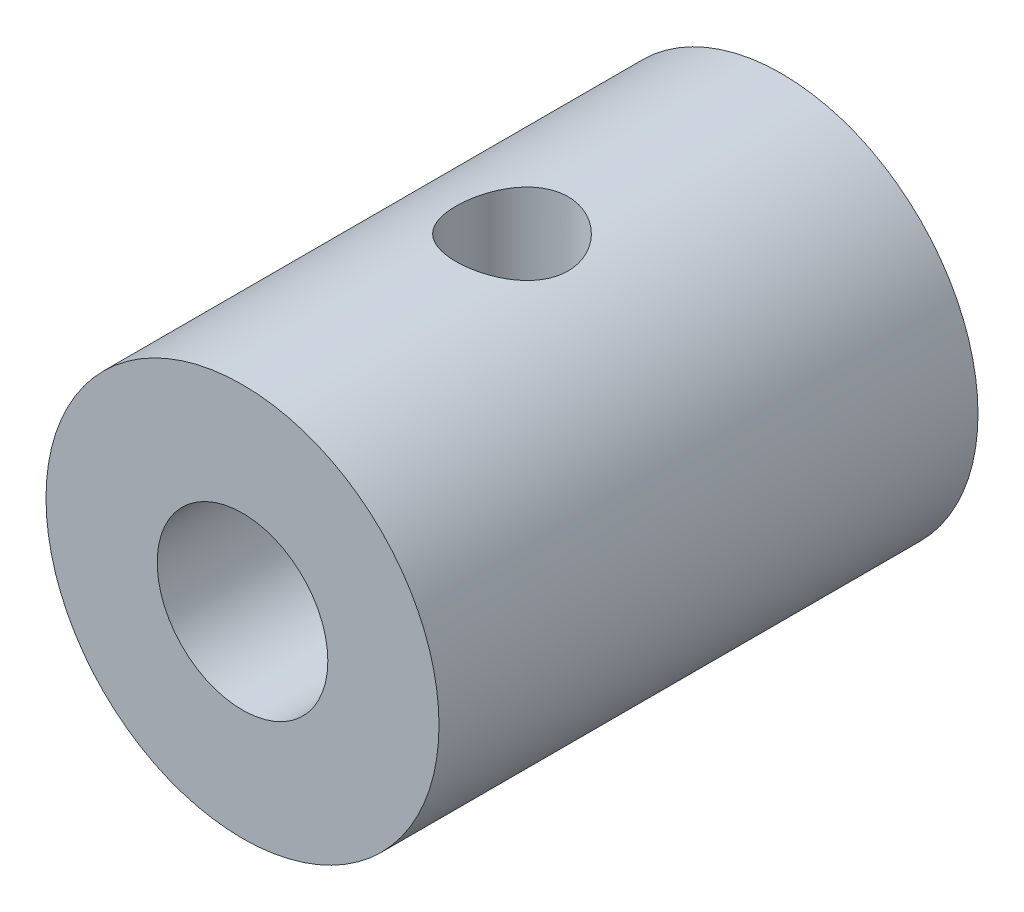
ISO-10303-21;
HEADER;
FILE_DESCRIPTION(('STEP AP214'),'2;1');
FILE_NAME('part.step','',(''),(''),'','','');
FILE_SCHEMA(('AUTOMOTIVE_DESIGN { 1 0 10303 214 1 1 1 1 }'));
ENDSEC;
DATA;
#1=APPLICATION_CONTEXT('core data for automotive mechanical design processes');
#2=APPLICATION_PROTOCOL_DEFINITION('international standard','automotive_design',2000,#1);
#3=PRODUCT_CONTEXT('',#1,'mechanical');
#4=PRODUCT('Part','Part','',(#3));
#5=PRODUCT_RELATED_PRODUCT_CATEGORY('part','',(#4));
#6=PRODUCT_DEFINITION_FORMATION('','',#4);
#7=PRODUCT_DEFINITION_CONTEXT('part definition',#1,'design');
#8=PRODUCT_DEFINITION('design','',#6,#7);
#9=PRODUCT_DEFINITION_SHAPE('','',#8);
#10=(LENGTH_UNIT() NAMED_UNIT(*) SI_UNIT(.MILLI.,.METRE.));
#11=(NAMED_UNIT(*) PLANE_ANGLE_UNIT() SI_UNIT($,.RADIAN.));
#12=(NAMED_UNIT(*) SI_UNIT($,.STERADIAN.) SOLID_ANGLE_UNIT());
#13=UNCERTAINTY_MEASURE_WITH_UNIT(LENGTH_MEASURE(1.E-05),#10,'distance_accuracy_value','');
#14=(GEOMETRIC_REPRESENTATION_CONTEXT(3) GLOBAL_UNCERTAINTY_ASSIGNED_CONTEXT((#13)) GLOBAL_UNIT_ASSIGNED_CONTEXT((#10,
#11,#12)) REPRESENTATION_CONTEXT('',''));
#15=CARTESIAN_POINT('',(0.,0.,0.));
#16=DIRECTION('',(0.,0.,1.));
#17=DIRECTION('',(1.,0.,0.));
#18=AXIS2_PLACEMENT_3D('',#15,#16,#17);
#19=CARTESIAN_POINT('',(0.,0.,-15.24));
#20=DIRECTION('',(0.,0.,1.));
#21=DIRECTION('',(1.,0.,0.));
#22=AXIS2_PLACEMENT_3D('',#19,#20,#21);
#23=CYLINDRICAL_SURFACE('',#22,5.55625);
#24=CARTESIAN_POINT('',(0.,-5.55625,-6.0325));
#25=CARTESIAN_POINT('',(-0.0872767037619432,-5.55624896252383,-6.0325015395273));
#26=CARTESIAN_POINT('',(-0.174569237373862,-5.55417368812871,-6.03972136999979));
#27=CARTESIAN_POINT('',(-0.34662426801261,-5.54609719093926,-6.06834913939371));
#28=CARTESIAN_POINT('',(-0.431385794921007,-5.54009448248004,-6.08976244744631));
#29=CARTESIAN_POINT('',(-0.595871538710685,-5.52482298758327,-6.1460126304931));
#30=CARTESIAN_POINT('',(-0.675602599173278,-5.51555875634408,-6.18083078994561));
#31=CARTESIAN_POINT('',(-0.828094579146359,-5.49473420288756,-6.26282878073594));
#32=CARTESIAN_POINT('',(-0.900854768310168,-5.48317364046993,-6.31000990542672));
#33=CARTESIAN_POINT('',(-1.03925246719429,-5.45865633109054,-6.41670278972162));
#34=CARTESIAN_POINT('',(-1.10468070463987,-5.44567302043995,-6.47647989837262));
#35=CARTESIAN_POINT('',(-1.22473351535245,-5.4199372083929,-6.60610164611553));
#36=CARTESIAN_POINT('',(-1.27935646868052,-5.40718474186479,-6.67594779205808));
#37=CARTESIAN_POINT('',(-1.37731333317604,-5.38307768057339,-6.82545115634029));
#38=CARTESIAN_POINT('',(-1.42039833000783,-5.37175632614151,-6.90527732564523));
#39=CARTESIAN_POINT('',(-1.49244979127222,-5.35218754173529,-7.07141715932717));
#40=CARTESIAN_POINT('',(-1.52141929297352,-5.34393945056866,-7.15772942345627));
#41=CARTESIAN_POINT('',(-1.56367506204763,-5.33172676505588,-7.33205509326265));
#42=CARTESIAN_POINT('',(-1.57734439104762,-5.32765776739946,-7.41996814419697));
#43=CARTESIAN_POINT('',(-1.58980717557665,-5.32395277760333,-7.59692659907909));
#44=CARTESIAN_POINT('',(-1.58860386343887,-5.32431582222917,-7.68597175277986));
#45=CARTESIAN_POINT('',(-1.57165781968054,-5.32934096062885,-7.85960821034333));
#46=CARTESIAN_POINT('',(-1.5563875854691,-5.33386333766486,-7.94425032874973));
#47=CARTESIAN_POINT('',(-1.51250162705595,-5.34647257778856,-8.1097177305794));
#48=CARTESIAN_POINT('',(-1.48388469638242,-5.3545597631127,-8.1905426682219));
#49=CARTESIAN_POINT('',(-1.41375353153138,-5.37350385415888,-8.34727045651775));
#50=CARTESIAN_POINT('',(-1.37208062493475,-5.38439452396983,-8.42309805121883));
#51=CARTESIAN_POINT('',(-1.27713088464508,-5.40770140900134,-8.56684577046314));
#52=CARTESIAN_POINT('',(-1.22385146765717,-5.42011796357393,-8.63476412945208));
#53=CARTESIAN_POINT('',(-1.1048237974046,-5.44565086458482,-8.76345432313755));
#54=CARTESIAN_POINT('',(-1.03868130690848,-5.45877594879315,-8.82386036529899));
#55=CARTESIAN_POINT('',(-0.897042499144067,-5.48383021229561,-8.93280376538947));
#56=CARTESIAN_POINT('',(-0.821545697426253,-5.49575932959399,-8.98134050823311));
#57=CARTESIAN_POINT('',(-0.662720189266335,-5.51716994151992,-9.06536218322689));
#58=CARTESIAN_POINT('',(-0.579350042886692,-5.52663737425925,-9.10077260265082));
#59=CARTESIAN_POINT('',(-0.407505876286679,-5.5419565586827,-9.1569650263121));
#60=CARTESIAN_POINT('',(-0.319033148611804,-5.54780922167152,-9.17775071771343));
#61=CARTESIAN_POINT('',(-0.142610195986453,-5.55509806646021,-9.20351004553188));
#62=CARTESIAN_POINT('',(-0.0547380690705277,-5.55667285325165,-9.20898010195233));
#63=CARTESIAN_POINT('',(0.120671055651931,-5.55563154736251,-9.20533523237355));
#64=CARTESIAN_POINT('',(0.208208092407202,-5.55301595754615,-9.19622205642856));
#65=CARTESIAN_POINT('',(0.378633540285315,-5.54397804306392,-9.16407358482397));
#66=CARTESIAN_POINT('',(0.461580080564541,-5.53763349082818,-9.14132253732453));
#67=CARTESIAN_POINT('',(0.622465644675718,-5.52186474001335,-9.08288085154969));
#68=CARTESIAN_POINT('',(0.700404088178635,-5.51244018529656,-9.04718871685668));
#69=CARTESIAN_POINT('',(0.850933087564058,-5.49124156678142,-8.96300647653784));
#70=CARTESIAN_POINT('',(0.923371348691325,-5.47942105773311,-8.91425604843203));
#71=CARTESIAN_POINT('',(1.05921058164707,-5.45479245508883,-8.80566207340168));
#72=CARTESIAN_POINT('',(1.12260949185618,-5.44198413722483,-8.7458160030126));
#73=CARTESIAN_POINT('',(1.24071572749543,-5.41630091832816,-8.61440258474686));
#74=CARTESIAN_POINT('',(1.29507093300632,-5.40343754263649,-8.54251587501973));
#75=CARTESIAN_POINT('',(1.39096378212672,-5.37955247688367,-8.39036407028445));
#76=CARTESIAN_POINT('',(1.43250187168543,-5.36853072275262,-8.31009926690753));
#77=CARTESIAN_POINT('',(1.50127854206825,-5.34970554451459,-8.14380260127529));
#78=CARTESIAN_POINT('',(1.52859290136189,-5.34188511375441,-8.05780411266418));
#79=CARTESIAN_POINT('',(1.56828688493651,-5.33036825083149,-7.88216773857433));
#80=CARTESIAN_POINT('',(1.58067103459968,-5.32667056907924,-7.79253096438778));
#81=CARTESIAN_POINT('',(1.58986556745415,-5.32393289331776,-7.61579627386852));
#82=CARTESIAN_POINT('',(1.58724621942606,-5.32472233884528,-7.52873025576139));
#83=CARTESIAN_POINT('',(1.56785239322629,-5.33046461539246,-7.35633630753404));
#84=CARTESIAN_POINT('',(1.55107838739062,-5.335417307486,-7.27100831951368));
#85=CARTESIAN_POINT('',(1.50420362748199,-5.34881913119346,-7.10534966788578));
#86=CARTESIAN_POINT('',(1.47424054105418,-5.35723208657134,-7.02497691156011));
#87=CARTESIAN_POINT('',(1.4019446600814,-5.37660296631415,-6.87033587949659));
#88=CARTESIAN_POINT('',(1.35960967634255,-5.38756134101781,-6.79606868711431));
#89=CARTESIAN_POINT('',(1.26211446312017,-5.41124512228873,-6.65306682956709));
#90=CARTESIAN_POINT('',(1.20657324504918,-5.42401730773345,-6.58459964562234));
#91=CARTESIAN_POINT('',(1.08494499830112,-5.44964814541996,-6.45777228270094));
#92=CARTESIAN_POINT('',(1.0188553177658,-5.46250681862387,-6.3994146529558));
#93=CARTESIAN_POINT('',(0.875962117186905,-5.48725692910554,-6.29297923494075));
#94=CARTESIAN_POINT('',(0.798927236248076,-5.49911508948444,-6.24520357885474));
#95=CARTESIAN_POINT('',(0.637580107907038,-5.52014545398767,-6.16335303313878));
#96=CARTESIAN_POINT('',(0.553271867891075,-5.52931912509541,-6.12927065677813));
#97=CARTESIAN_POINT('',(0.391252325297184,-5.54297329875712,-6.07945225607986));
#98=CARTESIAN_POINT('',(0.31413688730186,-5.54791311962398,-6.06188975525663));
#99=CARTESIAN_POINT('',(0.158018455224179,-5.55455172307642,-6.03841370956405));
#100=CARTESIAN_POINT('',(0.0790157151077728,-5.55625093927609,-6.03249860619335));
#101=CARTESIAN_POINT('',(0.,-5.55625,-6.0325));
#102=B_SPLINE_CURVE_WITH_KNOTS('',3,(#24,#25,#26,#27,#28,#29,#30,#31,#32,#33,#34,#35,#36,#37,
#38,#39,#40,#41,#42,#43,#44,#45,#46,#47,#48,#49,#50,#51,#52,#53,#54,#55,#56,#57,#58,#59,#60,#61,
#62,#63,#64,#65,#66,#67,#68,#69,#70,#71,#72,#73,#74,#75,#76,#77,#78,#79,#80,#81,#82,#83,#84,#85,
#86,#87,#88,#89,#90,#91,#92,#93,#94,#95,#96,#97,#98,#99,#100,#101),.UNSPECIFIED.,.T.,.F.,(4,2,2,
2,2,2,2,2,2,2,2,2,2,2,2,2,2,2,2,2,2,2,2,2,2,2,2,2,2,2,2,2,2,2,2,2,2,2,4),(0.,0.261540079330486,
0.523179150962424,0.784454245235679,1.04575668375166,1.31324200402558,1.5807673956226,
1.8536687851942,2.12651142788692,2.39235860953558,2.65814801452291,2.91532298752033,
3.17252121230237,3.43297512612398,3.69348706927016,3.96381684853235,4.23416063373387,
4.50601636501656,4.77780353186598,5.04067332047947,5.30351156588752,5.56105330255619,
5.81862482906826,6.08177223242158,6.34497955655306,6.6167960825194,6.88860315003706,
7.15894692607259,7.42920873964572,7.68926803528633,7.94931865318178,8.20671695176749,
8.46416082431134,8.73019952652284,8.99630521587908,9.26923770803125,9.54202077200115,
9.77883702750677,10.0156215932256),.UNSPECIFIED.);
#103=CARTESIAN_POINT('',(0.,-5.55625,-6.0325));
#104=VERTEX_POINT('',#103);
#105=EDGE_CURVE('E79',#104,#104,#102,.T.);
#106=ORIENTED_EDGE('',*,*,#105,.F.);
#107=EDGE_LOOP('',(#106));
#108=FACE_BOUND('',#107,.T.);
#109=CARTESIAN_POINT('',(0.,5.55625,-6.0325));
#110=CARTESIAN_POINT('',(0.0872767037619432,5.55624896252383,-6.0325015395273));
#111=CARTESIAN_POINT('',(0.174569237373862,5.55417368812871,-6.03972136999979));
#112=CARTESIAN_POINT('',(0.34662426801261,5.54609719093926,-6.06834913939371));
#113=CARTESIAN_POINT('',(0.431385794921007,5.54009448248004,-6.08976244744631));
#114=CARTESIAN_POINT('',(0.595871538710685,5.52482298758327,-6.1460126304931));
#115=CARTESIAN_POINT('',(0.675602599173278,5.51555875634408,-6.18083078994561));
#116=CARTESIAN_POINT('',(0.828094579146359,5.49473420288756,-6.26282878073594));
#117=CARTESIAN_POINT('',(0.900854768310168,5.48317364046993,-6.31000990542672));
#118=CARTESIAN_POINT('',(1.03925246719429,5.45865633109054,-6.41670278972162));
#119=CARTESIAN_POINT('',(1.10468070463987,5.44567302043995,-6.47647989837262));
#120=CARTESIAN_POINT('',(1.22473351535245,5.4199372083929,-6.60610164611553));
#121=CARTESIAN_POINT('',(1.27935646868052,5.40718474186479,-6.67594779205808));
#122=CARTESIAN_POINT('',(1.37731333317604,5.38307768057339,-6.82545115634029));
#123=CARTESIAN_POINT('',(1.42039833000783,5.37175632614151,-6.90527732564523));
#124=CARTESIAN_POINT('',(1.49244979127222,5.35218754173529,-7.07141715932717));
#125=CARTESIAN_POINT('',(1.52141929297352,5.34393945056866,-7.15772942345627));
#126=CARTESIAN_POINT('',(1.56367506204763,5.33172676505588,-7.33205509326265));
#127=CARTESIAN_POINT('',(1.57734439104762,5.32765776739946,-7.41996814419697));
#128=CARTESIAN_POINT('',(1.58980717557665,5.32395277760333,-7.59692659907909));
#129=CARTESIAN_POINT('',(1.58860386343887,5.32431582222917,-7.68597175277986));
#130=CARTESIAN_POINT('',(1.57165781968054,5.32934096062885,-7.85960821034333));
#131=CARTESIAN_POINT('',(1.5563875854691,5.33386333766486,-7.94425032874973));
#132=CARTESIAN_POINT('',(1.51250162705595,5.34647257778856,-8.1097177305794));
#133=CARTESIAN_POINT('',(1.48388469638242,5.3545597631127,-8.1905426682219));
#134=CARTESIAN_POINT('',(1.41375353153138,5.37350385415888,-8.34727045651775));
#135=CARTESIAN_POINT('',(1.37208062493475,5.38439452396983,-8.42309805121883));
#136=CARTESIAN_POINT('',(1.27713088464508,5.40770140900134,-8.56684577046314));
#137=CARTESIAN_POINT('',(1.22385146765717,5.42011796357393,-8.63476412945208));
#138=CARTESIAN_POINT('',(1.1048237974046,5.44565086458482,-8.76345432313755));
#139=CARTESIAN_POINT('',(1.03868130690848,5.45877594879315,-8.82386036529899));
#140=CARTESIAN_POINT('',(0.897042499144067,5.48383021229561,-8.93280376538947));
#141=CARTESIAN_POINT('',(0.821545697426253,5.49575932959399,-8.98134050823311));
#142=CARTESIAN_POINT('',(0.662720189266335,5.51716994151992,-9.06536218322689));
#143=CARTESIAN_POINT('',(0.579350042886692,5.52663737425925,-9.10077260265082));
#144=CARTESIAN_POINT('',(0.407505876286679,5.5419565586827,-9.1569650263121));
#145=CARTESIAN_POINT('',(0.319033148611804,5.54780922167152,-9.17775071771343));
#146=CARTESIAN_POINT('',(0.142610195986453,5.55509806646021,-9.20351004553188));
#147=CARTESIAN_POINT('',(0.0547380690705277,5.55667285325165,-9.20898010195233));
#148=CARTESIAN_POINT('',(-0.120671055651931,5.55563154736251,-9.20533523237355));
#149=CARTESIAN_POINT('',(-0.208208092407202,5.55301595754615,-9.19622205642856));
#150=CARTESIAN_POINT('',(-0.378633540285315,5.54397804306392,-9.16407358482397));
#151=CARTESIAN_POINT('',(-0.461580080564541,5.53763349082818,-9.14132253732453));
#152=CARTESIAN_POINT('',(-0.622465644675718,5.52186474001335,-9.08288085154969));
#153=CARTESIAN_POINT('',(-0.700404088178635,5.51244018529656,-9.04718871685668));
#154=CARTESIAN_POINT('',(-0.850933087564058,5.49124156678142,-8.96300647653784));
#155=CARTESIAN_POINT('',(-0.923371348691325,5.47942105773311,-8.91425604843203));
#156=CARTESIAN_POINT('',(-1.05921058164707,5.45479245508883,-8.80566207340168));
#157=CARTESIAN_POINT('',(-1.12260949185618,5.44198413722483,-8.7458160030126));
#158=CARTESIAN_POINT('',(-1.24071572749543,5.41630091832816,-8.61440258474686));
#159=CARTESIAN_POINT('',(-1.29507093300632,5.40343754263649,-8.54251587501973));
#160=CARTESIAN_POINT('',(-1.39096378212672,5.37955247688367,-8.39036407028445));
#161=CARTESIAN_POINT('',(-1.43250187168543,5.36853072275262,-8.31009926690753));
#162=CARTESIAN_POINT('',(-1.50127854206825,5.34970554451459,-8.14380260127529));
#163=CARTESIAN_POINT('',(-1.52859290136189,5.34188511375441,-8.05780411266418));
#164=CARTESIAN_POINT('',(-1.56828688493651,5.33036825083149,-7.88216773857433));
#165=CARTESIAN_POINT('',(-1.58067103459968,5.32667056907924,-7.79253096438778));
#166=CARTESIAN_POINT('',(-1.58986556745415,5.32393289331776,-7.61579627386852));
#167=CARTESIAN_POINT('',(-1.58724621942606,5.32472233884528,-7.52873025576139));
#168=CARTESIAN_POINT('',(-1.56785239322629,5.33046461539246,-7.35633630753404));
#169=CARTESIAN_POINT('',(-1.55107838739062,5.335417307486,-7.27100831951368));
#170=CARTESIAN_POINT('',(-1.50420362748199,5.34881913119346,-7.10534966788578));
#171=CARTESIAN_POINT('',(-1.47424054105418,5.35723208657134,-7.02497691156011));
#172=CARTESIAN_POINT('',(-1.4019446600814,5.37660296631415,-6.87033587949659));
#173=CARTESIAN_POINT('',(-1.35960967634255,5.38756134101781,-6.79606868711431));
#174=CARTESIAN_POINT('',(-1.26211446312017,5.41124512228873,-6.65306682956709));
#175=CARTESIAN_POINT('',(-1.20657324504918,5.42401730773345,-6.58459964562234));
#176=CARTESIAN_POINT('',(-1.08494499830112,5.44964814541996,-6.45777228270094));
#177=CARTESIAN_POINT('',(-1.0188553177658,5.46250681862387,-6.3994146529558));
#178=CARTESIAN_POINT('',(-0.875962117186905,5.48725692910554,-6.29297923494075));
#179=CARTESIAN_POINT('',(-0.798927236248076,5.49911508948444,-6.24520357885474));
#180=CARTESIAN_POINT('',(-0.637580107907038,5.52014545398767,-6.16335303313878));
#181=CARTESIAN_POINT('',(-0.553271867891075,5.52931912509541,-6.12927065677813));
#182=CARTESIAN_POINT('',(-0.391252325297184,5.54297329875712,-6.07945225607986));
#183=CARTESIAN_POINT('',(-0.31413688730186,5.54791311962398,-6.06188975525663));
#184=CARTESIAN_POINT('',(-0.158018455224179,5.55455172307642,-6.03841370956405));
#185=CARTESIAN_POINT('',(-0.0790157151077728,5.55625093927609,-6.03249860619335));
#186=CARTESIAN_POINT('',(0.,5.55625,-6.0325));
#187=B_SPLINE_CURVE_WITH_KNOTS('',3,(#109,#110,#111,#112,#113,#114,#115,#116,#117,#118,#119,
#120,#121,#122,#123,#124,#125,#126,#127,#128,#129,#130,#131,#132,#133,#134,#135,#136,#137,#138,
#139,#140,#141,#142,#143,#144,#145,#146,#147,#148,#149,#150,#151,#152,#153,#154,#155,#156,#157,
#158,#159,#160,#161,#162,#163,#164,#165,#166,#167,#168,#169,#170,#171,#172,#173,#174,#175,#176,
#177,#178,#179,#180,#181,#182,#183,#184,#185,#186),.UNSPECIFIED.,.T.,.F.,(4,2,2,2,2,2,2,2,2,2,2,
2,2,2,2,2,2,2,2,2,2,2,2,2,2,2,2,2,2,2,2,2,2,2,2,2,2,2,4),(0.,0.261540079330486,
0.523179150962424,0.784454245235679,1.04575668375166,1.31324200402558,1.5807673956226,
1.8536687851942,2.12651142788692,2.39235860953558,2.65814801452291,2.91532298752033,
3.17252121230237,3.43297512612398,3.69348706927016,3.96381684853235,4.23416063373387,
4.50601636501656,4.77780353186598,5.04067332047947,5.30351156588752,5.56105330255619,
5.81862482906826,6.08177223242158,6.34497955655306,6.6167960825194,6.88860315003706,
7.15894692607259,7.42920873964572,7.68926803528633,7.94931865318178,8.20671695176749,
8.46416082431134,8.73019952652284,8.99630521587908,9.26923770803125,9.54202077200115,
9.77883702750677,10.0156215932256),.UNSPECIFIED.);
#188=CARTESIAN_POINT('',(0.,5.55625,-6.0325));
#189=VERTEX_POINT('',#188);
#190=EDGE_CURVE('E74',#189,#189,#187,.T.);
#191=ORIENTED_EDGE('',*,*,#190,.F.);
#192=EDGE_LOOP('',(#191));
#193=FACE_BOUND('',#192,.T.);
#194=CARTESIAN_POINT('',(0.,0.,-15.24));
#195=DIRECTION('',(0.,0.,1.));
#196=DIRECTION('',(1.,0.,0.));
#197=AXIS2_PLACEMENT_3D('',#194,#195,#196);
#198=CIRCLE('',#197,5.55625);
#199=CARTESIAN_POINT('',(5.55625,0.,-15.24));
#200=VERTEX_POINT('',#199);
#201=EDGE_CURVE('E10',#200,#200,#198,.T.);
#202=ORIENTED_EDGE('',*,*,#201,.T.);
#203=EDGE_LOOP('',(#202));
#204=FACE_BOUND('',#203,.T.);
#205=CARTESIAN_POINT('',(0.,0.,0.));
#206=DIRECTION('',(0.,0.,1.));
#207=DIRECTION('',(1.,0.,0.));
#208=AXIS2_PLACEMENT_3D('',#205,#206,#207);
#209=CIRCLE('',#208,5.55625);
#210=CARTESIAN_POINT('',(5.55625,0.,0.));
#211=VERTEX_POINT('',#210);
#212=EDGE_CURVE('E46',#211,#211,#209,.T.);
#213=ORIENTED_EDGE('',*,*,#212,.F.);
#214=EDGE_LOOP('',(#213));
#215=FACE_BOUND('',#214,.T.);
#216=ADVANCED_FACE('F33',(#108,#193,#204,#215),#23,.T.);
#217=CARTESIAN_POINT('',(0.,0.,-15.24));
#218=DIRECTION('',(0.,0.,1.));
#219=DIRECTION('',(1.,0.,0.));
#220=AXIS2_PLACEMENT_3D('',#217,#218,#219);
#221=PLANE('',#220);
#222=CARTESIAN_POINT('',(0.,0.,-15.24));
#223=DIRECTION('',(0.,0.,1.));
#224=DIRECTION('',(1.,0.,0.));
#225=AXIS2_PLACEMENT_3D('',#222,#223,#224);
#226=CIRCLE('',#225,2.413);
#227=CARTESIAN_POINT('',(2.413,0.,-15.24));
#228=VERTEX_POINT('',#227);
#229=EDGE_CURVE('E51',#228,#228,#226,.T.);
#230=ORIENTED_EDGE('',*,*,#229,.T.);
#231=EDGE_LOOP('',(#230));
#232=FACE_BOUND('',#231,.T.);
#233=ORIENTED_EDGE('',*,*,#201,.F.);
#234=EDGE_LOOP('',(#233));
#235=FACE_BOUND('',#234,.T.);
#236=ADVANCED_FACE('F94',(#232,#235),#221,.F.);
#237=CARTESIAN_POINT('',(0.,0.,0.));
#238=DIRECTION('',(0.,0.,1.));
#239=DIRECTION('',(1.,0.,0.));
#240=AXIS2_PLACEMENT_3D('',#237,#238,#239);
#241=PLANE('',#240);
#242=CARTESIAN_POINT('',(0.,0.,0.));
#243=DIRECTION('',(0.,0.,1.));
#244=DIRECTION('',(1.,0.,0.));
#245=AXIS2_PLACEMENT_3D('',#242,#243,#244);
#246=CIRCLE('',#245,2.413);
#247=CARTESIAN_POINT('',(2.413,0.,0.));
#248=VERTEX_POINT('',#247);
#249=EDGE_CURVE('E54',#248,#248,#246,.T.);
#250=ORIENTED_EDGE('',*,*,#249,.F.);
#251=EDGE_LOOP('',(#250));
#252=FACE_BOUND('',#251,.T.);
#253=ORIENTED_EDGE('',*,*,#212,.T.);
#254=EDGE_LOOP('',(#253));
#255=FACE_BOUND('',#254,.T.);
#256=ADVANCED_FACE('F91',(#252,#255),#241,.T.);
#257=CARTESIAN_POINT('',(0.,0.,-15.24));
#258=DIRECTION('',(0.,0.,1.));
#259=DIRECTION('',(1.,0.,0.));
#260=AXIS2_PLACEMENT_3D('',#257,#258,#259);
#261=CYLINDRICAL_SURFACE('',#260,2.413);
#262=CARTESIAN_POINT('',(0.,-2.413,-6.0325));
#263=CARTESIAN_POINT('',(-0.0799588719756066,-2.41299835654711,-6.03250167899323));
#264=CARTESIAN_POINT('',(-0.159933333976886,-2.40898996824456,-6.0385753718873));
#265=CARTESIAN_POINT('',(-0.31734518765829,-2.39335125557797,-6.06250280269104));
#266=CARTESIAN_POINT('',(-0.39478086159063,-2.38171587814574,-6.08036435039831));
#267=CARTESIAN_POINT('',(-0.544600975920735,-2.35197589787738,-6.12678437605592));
#268=CARTESIAN_POINT('',(-0.617007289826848,-2.33390171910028,-6.15529257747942));
#269=CARTESIAN_POINT('',(-0.755727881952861,-2.29274654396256,-6.2218027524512));
#270=CARTESIAN_POINT('',(-0.822041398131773,-2.26966492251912,-6.25980591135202));
#271=CARTESIAN_POINT('',(-0.952971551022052,-2.21805576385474,-6.34770575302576));
#272=CARTESIAN_POINT('',(-1.01697952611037,-2.18923385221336,-6.39833257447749));
#273=CARTESIAN_POINT('',(-1.13617571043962,-2.12981680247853,-6.50831199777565));
#274=CARTESIAN_POINT('',(-1.19135125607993,-2.09921920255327,-6.56767689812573));
#275=CARTESIAN_POINT('',(-1.29994052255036,-2.03403850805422,-6.70401260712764));
#276=CARTESIAN_POINT('',(-1.35179336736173,-1.99956180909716,-6.78228745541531));
#277=CARTESIAN_POINT('',(-1.44152434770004,-1.93587363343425,-6.94840765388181));
#278=CARTESIAN_POINT('',(-1.479426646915,-1.90665309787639,-7.03623611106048));
#279=CARTESIAN_POINT('',(-1.53081720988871,-1.8654576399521,-7.19391086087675));
#280=CARTESIAN_POINT('',(-1.54817785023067,-1.85094275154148,-7.26182519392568));
#281=CARTESIAN_POINT('',(-1.57381605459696,-1.82919719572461,-7.40043861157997));
#282=CARTESIAN_POINT('',(-1.58210865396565,-1.82195447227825,-7.47113288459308));
#283=CARTESIAN_POINT('',(-1.58909442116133,-1.81586727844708,-7.6136379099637));
#284=CARTESIAN_POINT('',(-1.58775173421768,-1.81705417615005,-7.68545183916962));
#285=CARTESIAN_POINT('',(-1.57548041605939,-1.82770073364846,-7.82765505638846));
#286=CARTESIAN_POINT('',(-1.56454370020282,-1.83716737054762,-7.89804309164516));
#287=CARTESIAN_POINT('',(-1.53438969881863,-1.8624122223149,-8.03278512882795));
#288=CARTESIAN_POINT('',(-1.51551302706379,-1.87792908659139,-8.0972674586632));
#289=CARTESIAN_POINT('',(-1.47034216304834,-1.91350135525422,-8.22222028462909));
#290=CARTESIAN_POINT('',(-1.44404553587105,-1.93355824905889,-8.28268945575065));
#291=CARTESIAN_POINT('',(-1.37874791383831,-1.98079549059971,-8.41080095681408));
#292=CARTESIAN_POINT('',(-1.33825710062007,-2.00859791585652,-8.47745281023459));
#293=CARTESIAN_POINT('',(-1.24833470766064,-2.06568961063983,-8.60378803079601));
#294=CARTESIAN_POINT('',(-1.19889220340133,-2.09498066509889,-8.66346273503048));
#295=CARTESIAN_POINT('',(-1.08065804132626,-2.158733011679,-8.78663353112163));
#296=CARTESIAN_POINT('',(-1.00997691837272,-2.19302872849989,-8.84842174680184));
#297=CARTESIAN_POINT('',(-0.857461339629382,-2.25702187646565,-8.9593203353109));
#298=CARTESIAN_POINT('',(-0.775638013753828,-2.28672383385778,-9.00844321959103));
#299=CARTESIAN_POINT('',(-0.619595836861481,-2.33322350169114,-9.08362744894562));
#300=CARTESIAN_POINT('',(-0.547063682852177,-2.35141109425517,-9.11232689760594));
#301=CARTESIAN_POINT('',(-0.397349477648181,-2.3812794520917,-9.15896140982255));
#302=CARTESIAN_POINT('',(-0.320171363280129,-2.39296564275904,-9.17690544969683));
#303=CARTESIAN_POINT('',(-0.162905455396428,-2.40879578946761,-9.20112926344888));
#304=CARTESIAN_POINT('',(-0.0828073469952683,-2.41290968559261,-9.20736255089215));
#305=CARTESIAN_POINT('',(0.0774224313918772,-2.41308731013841,-9.20763288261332));
#306=CARTESIAN_POINT('',(0.15755410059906,-2.40915121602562,-9.20167019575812));
#307=CARTESIAN_POINT('',(0.310151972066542,-2.39413427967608,-9.1786962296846));
#308=CARTESIAN_POINT('',(0.382779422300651,-2.3835300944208,-9.16242153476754));
#309=CARTESIAN_POINT('',(0.524047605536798,-2.35650584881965,-9.120322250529));
#310=CARTESIAN_POINT('',(0.592687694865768,-2.34008485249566,-9.09449612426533));
#311=CARTESIAN_POINT('',(0.729044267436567,-2.30139348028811,-9.0323139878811));
#312=CARTESIAN_POINT('',(0.796405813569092,-2.27881043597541,-8.99537910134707));
#313=CARTESIAN_POINT('',(0.924235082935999,-2.23003319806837,-8.9129574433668));
#314=CARTESIAN_POINT('',(0.984698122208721,-2.20383657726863,-8.86746491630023));
#315=CARTESIAN_POINT('',(1.10702139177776,-2.14531062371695,-8.76114857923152));
#316=CARTESIAN_POINT('',(1.16761337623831,-2.11266384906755,-8.69903926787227));
#317=CARTESIAN_POINT('',(1.27804416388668,-2.04774901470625,-8.56565433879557));
#318=CARTESIAN_POINT('',(1.32787711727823,-2.01548116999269,-8.49437376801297));
#319=CARTESIAN_POINT('',(1.4112232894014,-1.95788457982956,-8.35125276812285));
#320=CARTESIAN_POINT('',(1.44589422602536,-1.93218319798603,-8.28024013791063));
#321=CARTESIAN_POINT('',(1.50469449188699,-1.8867567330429,-8.13221510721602));
#322=CARTESIAN_POINT('',(1.52884286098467,-1.86702087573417,-8.05521384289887));
#323=CARTESIAN_POINT('',(1.56231525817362,-1.83905936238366,-7.90973144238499));
#324=CARTESIAN_POINT('',(1.5734227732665,-1.82947554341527,-7.84192837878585));
#325=CARTESIAN_POINT('',(1.58672331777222,-1.81795542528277,-7.70483162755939));
#326=CARTESIAN_POINT('',(1.58892454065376,-1.81601209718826,-7.635539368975));
#327=CARTESIAN_POINT('',(1.58427385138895,-1.82006930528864,-7.49751688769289));
#328=CARTESIAN_POINT('',(1.57742315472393,-1.82606877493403,-7.42878659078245));
#329=CARTESIAN_POINT('',(1.55511847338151,-1.8450971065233,-7.29371173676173));
#330=CARTESIAN_POINT('',(1.53965318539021,-1.85813520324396,-7.22737043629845));
#331=CARTESIAN_POINT('',(1.49541513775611,-1.89402181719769,-7.08024277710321));
#332=CARTESIAN_POINT('',(1.46412276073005,-1.9185982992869,-7.00064253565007));
#333=CARTESIAN_POINT('',(1.39017287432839,-1.97283748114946,-6.84881027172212));
#334=CARTESIAN_POINT('',(1.34749962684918,-2.00250720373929,-6.77658864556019));
#335=CARTESIAN_POINT('',(1.25103580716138,-2.06417332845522,-6.63906478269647));
#336=CARTESIAN_POINT('',(1.19707006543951,-2.09620050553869,-6.57389960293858));
#337=CARTESIAN_POINT('',(1.07919367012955,-2.15925474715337,-6.45267580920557));
#338=CARTESIAN_POINT('',(1.01528024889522,-2.19028153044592,-6.39661973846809));
#339=CARTESIAN_POINT('',(0.869916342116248,-2.25228411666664,-6.28862709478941));
#340=CARTESIAN_POINT('',(0.787280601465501,-2.28280298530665,-6.23800151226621));
#341=CARTESIAN_POINT('',(0.612112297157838,-2.3358521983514,-6.15202924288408));
#342=CARTESIAN_POINT('',(0.519599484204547,-2.35839811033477,-6.11665275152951));
#343=CARTESIAN_POINT('',(0.355448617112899,-2.3876883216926,-6.0711797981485));
#344=CARTESIAN_POINT('',(0.285472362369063,-2.39711346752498,-6.05673690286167));
#345=CARTESIAN_POINT('',(0.143667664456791,-2.40976856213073,-6.03739853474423));
#346=CARTESIAN_POINT('',(0.0718401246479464,-2.41300147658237,-6.03249849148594));
#347=CARTESIAN_POINT('',(0.,-2.413,-6.0325));
#348=B_SPLINE_CURVE_WITH_KNOTS('',3,(#262,#263,#264,#265,#266,#267,#268,#269,#270,#271,#272,
#273,#274,#275,#276,#277,#278,#279,#280,#281,#282,#283,#284,#285,#286,#287,#288,#289,#290,#291,
#292,#293,#294,#295,#296,#297,#298,#299,#300,#301,#302,#303,#304,#305,#306,#307,#308,#309,#310,
#311,#312,#313,#314,#315,#316,#317,#318,#319,#320,#321,#322,#323,#324,#325,#326,#327,#328,#329,
#330,#331,#332,#333,#334,#335,#336,#337,#338,#339,#340,#341,#342,#343,#344,#345,#346,#347),
.UNSPECIFIED.,.T.,.F.,(4,2,2,2,2,2,2,2,2,2,2,2,2,2,2,2,2,2,2,2,2,2,2,2,2,2,2,2,2,2,2,2,2,2,2,2,
2,2,2,2,2,2,4),(0.,0.239585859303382,0.479330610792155,0.717957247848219,0.956613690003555,
1.21528407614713,1.47432207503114,1.77298889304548,2.07113592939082,2.28503135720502,
2.49857159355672,2.71290686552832,2.9274229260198,3.13354851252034,3.33974181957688,
3.58725053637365,3.83506337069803,4.13347849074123,4.43159768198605,4.67087501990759,
4.90995238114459,5.14997678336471,5.38999589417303,5.61455116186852,5.83914257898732,
6.07844377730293,6.31790650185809,6.59492743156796,6.872098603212,7.12046914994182,
7.36838840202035,7.57558457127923,7.78259008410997,7.98956780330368,8.19681774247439,
8.46236659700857,8.72828458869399,8.99868215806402,9.26915509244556,9.57222987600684,
9.87470958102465,10.0900718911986,10.305331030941),.UNSPECIFIED.);
#349=CARTESIAN_POINT('',(0.,-2.413,-6.0325));
#350=VERTEX_POINT('',#349);
#351=EDGE_CURVE('E37',#350,#350,#348,.T.);
#352=ORIENTED_EDGE('',*,*,#351,.T.);
#353=EDGE_LOOP('',(#352));
#354=FACE_BOUND('',#353,.T.);
#355=CARTESIAN_POINT('',(0.,2.413,-6.0325));
#356=CARTESIAN_POINT('',(0.0799588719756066,2.41299835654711,-6.03250167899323));
#357=CARTESIAN_POINT('',(0.159933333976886,2.40898996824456,-6.0385753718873));
#358=CARTESIAN_POINT('',(0.31734518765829,2.39335125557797,-6.06250280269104));
#359=CARTESIAN_POINT('',(0.39478086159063,2.38171587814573,-6.08036435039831));
#360=CARTESIAN_POINT('',(0.544600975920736,2.35197589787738,-6.12678437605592));
#361=CARTESIAN_POINT('',(0.617007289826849,2.33390171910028,-6.15529257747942));
#362=CARTESIAN_POINT('',(0.755727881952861,2.29274654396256,-6.2218027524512));
#363=CARTESIAN_POINT('',(0.822041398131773,2.26966492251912,-6.25980591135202));
#364=CARTESIAN_POINT('',(0.952971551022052,2.21805576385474,-6.34770575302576));
#365=CARTESIAN_POINT('',(1.01697952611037,2.18923385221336,-6.39833257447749));
#366=CARTESIAN_POINT('',(1.13617571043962,2.12981680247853,-6.50831199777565));
#367=CARTESIAN_POINT('',(1.19135125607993,2.09921920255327,-6.56767689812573));
#368=CARTESIAN_POINT('',(1.29994052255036,2.03403850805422,-6.70401260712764));
#369=CARTESIAN_POINT('',(1.35179336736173,1.99956180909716,-6.78228745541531));
#370=CARTESIAN_POINT('',(1.44152434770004,1.93587363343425,-6.94840765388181));
#371=CARTESIAN_POINT('',(1.479426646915,1.90665309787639,-7.03623611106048));
#372=CARTESIAN_POINT('',(1.53081720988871,1.8654576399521,-7.19391086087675));
#373=CARTESIAN_POINT('',(1.54817785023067,1.85094275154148,-7.26182519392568));
#374=CARTESIAN_POINT('',(1.57381605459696,1.82919719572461,-7.40043861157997));
#375=CARTESIAN_POINT('',(1.58210865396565,1.82195447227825,-7.47113288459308));
#376=CARTESIAN_POINT('',(1.58909442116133,1.81586727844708,-7.6136379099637));
#377=CARTESIAN_POINT('',(1.58775173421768,1.81705417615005,-7.68545183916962));
#378=CARTESIAN_POINT('',(1.57548041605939,1.82770073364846,-7.82765505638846));
#379=CARTESIAN_POINT('',(1.56454370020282,1.83716737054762,-7.89804309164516));
#380=CARTESIAN_POINT('',(1.53438969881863,1.8624122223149,-8.03278512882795));
#381=CARTESIAN_POINT('',(1.51551302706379,1.87792908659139,-8.0972674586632));
#382=CARTESIAN_POINT('',(1.47034216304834,1.91350135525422,-8.22222028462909));
#383=CARTESIAN_POINT('',(1.44404553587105,1.93355824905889,-8.28268945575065));
#384=CARTESIAN_POINT('',(1.37874791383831,1.98079549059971,-8.41080095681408));
#385=CARTESIAN_POINT('',(1.33825710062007,2.00859791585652,-8.47745281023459));
#386=CARTESIAN_POINT('',(1.24833470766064,2.06568961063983,-8.60378803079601));
#387=CARTESIAN_POINT('',(1.19889220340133,2.09498066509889,-8.66346273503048));
#388=CARTESIAN_POINT('',(1.08065804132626,2.158733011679,-8.78663353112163));
#389=CARTESIAN_POINT('',(1.00997691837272,2.19302872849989,-8.84842174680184));
#390=CARTESIAN_POINT('',(0.857461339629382,2.25702187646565,-8.9593203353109));
#391=CARTESIAN_POINT('',(0.775638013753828,2.28672383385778,-9.00844321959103));
#392=CARTESIAN_POINT('',(0.619595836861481,2.33322350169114,-9.08362744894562));
#393=CARTESIAN_POINT('',(0.547063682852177,2.35141109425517,-9.11232689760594));
#394=CARTESIAN_POINT('',(0.397349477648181,2.3812794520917,-9.15896140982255));
#395=CARTESIAN_POINT('',(0.320171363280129,2.39296564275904,-9.17690544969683));
#396=CARTESIAN_POINT('',(0.162905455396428,2.40879578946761,-9.20112926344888));
#397=CARTESIAN_POINT('',(0.0828073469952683,2.41290968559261,-9.20736255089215));
#398=CARTESIAN_POINT('',(-0.0774224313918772,2.41308731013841,-9.20763288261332));
#399=CARTESIAN_POINT('',(-0.15755410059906,2.40915121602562,-9.20167019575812));
#400=CARTESIAN_POINT('',(-0.310151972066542,2.39413427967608,-9.1786962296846));
#401=CARTESIAN_POINT('',(-0.382779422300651,2.3835300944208,-9.16242153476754));
#402=CARTESIAN_POINT('',(-0.524047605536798,2.35650584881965,-9.120322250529));
#403=CARTESIAN_POINT('',(-0.592687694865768,2.34008485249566,-9.09449612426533));
#404=CARTESIAN_POINT('',(-0.729044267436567,2.30139348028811,-9.0323139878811));
#405=CARTESIAN_POINT('',(-0.796405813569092,2.27881043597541,-8.99537910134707));
#406=CARTESIAN_POINT('',(-0.924235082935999,2.23003319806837,-8.9129574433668));
#407=CARTESIAN_POINT('',(-0.984698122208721,2.20383657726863,-8.86746491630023));
#408=CARTESIAN_POINT('',(-1.10702139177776,2.14531062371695,-8.76114857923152));
#409=CARTESIAN_POINT('',(-1.16761337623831,2.11266384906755,-8.69903926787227));
#410=CARTESIAN_POINT('',(-1.27804416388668,2.04774901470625,-8.56565433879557));
#411=CARTESIAN_POINT('',(-1.32787711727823,2.01548116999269,-8.49437376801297));
#412=CARTESIAN_POINT('',(-1.4112232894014,1.95788457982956,-8.35125276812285));
#413=CARTESIAN_POINT('',(-1.44589422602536,1.93218319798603,-8.28024013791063));
#414=CARTESIAN_POINT('',(-1.50469449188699,1.8867567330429,-8.13221510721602));
#415=CARTESIAN_POINT('',(-1.52884286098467,1.86702087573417,-8.05521384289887));
#416=CARTESIAN_POINT('',(-1.56231525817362,1.83905936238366,-7.90973144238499));
#417=CARTESIAN_POINT('',(-1.5734227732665,1.82947554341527,-7.84192837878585));
#418=CARTESIAN_POINT('',(-1.58672331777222,1.81795542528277,-7.70483162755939));
#419=CARTESIAN_POINT('',(-1.58892454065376,1.81601209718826,-7.635539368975));
#420=CARTESIAN_POINT('',(-1.58427385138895,1.82006930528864,-7.49751688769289));
#421=CARTESIAN_POINT('',(-1.57742315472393,1.82606877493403,-7.42878659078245));
#422=CARTESIAN_POINT('',(-1.55511847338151,1.8450971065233,-7.29371173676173));
#423=CARTESIAN_POINT('',(-1.53965318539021,1.85813520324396,-7.22737043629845));
#424=CARTESIAN_POINT('',(-1.49541513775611,1.89402181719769,-7.08024277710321));
#425=CARTESIAN_POINT('',(-1.46412276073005,1.9185982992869,-7.00064253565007));
#426=CARTESIAN_POINT('',(-1.39017287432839,1.97283748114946,-6.84881027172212));
#427=CARTESIAN_POINT('',(-1.34749962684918,2.00250720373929,-6.77658864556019));
#428=CARTESIAN_POINT('',(-1.25103580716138,2.06417332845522,-6.63906478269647));
#429=CARTESIAN_POINT('',(-1.19707006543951,2.09620050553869,-6.57389960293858));
#430=CARTESIAN_POINT('',(-1.07919367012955,2.15925474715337,-6.45267580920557));
#431=CARTESIAN_POINT('',(-1.01528024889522,2.19028153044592,-6.39661973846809));
#432=CARTESIAN_POINT('',(-0.869916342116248,2.25228411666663,-6.28862709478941));
#433=CARTESIAN_POINT('',(-0.787280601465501,2.28280298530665,-6.23800151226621));
#434=CARTESIAN_POINT('',(-0.612112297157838,2.3358521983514,-6.15202924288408));
#435=CARTESIAN_POINT('',(-0.519599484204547,2.35839811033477,-6.11665275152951));
#436=CARTESIAN_POINT('',(-0.355448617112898,2.3876883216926,-6.0711797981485));
#437=CARTESIAN_POINT('',(-0.285472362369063,2.39711346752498,-6.05673690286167));
#438=CARTESIAN_POINT('',(-0.143667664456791,2.40976856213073,-6.03739853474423));
#439=CARTESIAN_POINT('',(-0.0718401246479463,2.41300147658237,-6.03249849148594));
#440=CARTESIAN_POINT('',(0.,2.413,-6.0325));
#441=B_SPLINE_CURVE_WITH_KNOTS('',3,(#355,#356,#357,#358,#359,#360,#361,#362,#363,#364,#365,
#366,#367,#368,#369,#370,#371,#372,#373,#374,#375,#376,#377,#378,#379,#380,#381,#382,#383,#384,
#385,#386,#387,#388,#389,#390,#391,#392,#393,#394,#395,#396,#397,#398,#399,#400,#401,#402,#403,
#404,#405,#406,#407,#408,#409,#410,#411,#412,#413,#414,#415,#416,#417,#418,#419,#420,#421,#422,
#423,#424,#425,#426,#427,#428,#429,#430,#431,#432,#433,#434,#435,#436,#437,#438,#439,#440),
.UNSPECIFIED.,.T.,.F.,(4,2,2,2,2,2,2,2,2,2,2,2,2,2,2,2,2,2,2,2,2,2,2,2,2,2,2,2,2,2,2,2,2,2,2,2,
2,2,2,2,2,2,4),(0.,0.239585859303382,0.479330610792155,0.717957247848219,0.956613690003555,
1.21528407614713,1.47432207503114,1.77298889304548,2.07113592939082,2.28503135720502,
2.49857159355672,2.71290686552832,2.9274229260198,3.13354851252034,3.33974181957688,
3.58725053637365,3.83506337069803,4.13347849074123,4.43159768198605,4.67087501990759,
4.90995238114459,5.14997678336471,5.38999589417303,5.61455116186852,5.83914257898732,
6.07844377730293,6.31790650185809,6.59492743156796,6.872098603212,7.12046914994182,
7.36838840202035,7.57558457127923,7.78259008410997,7.98956780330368,8.19681774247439,
8.46236659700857,8.72828458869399,8.99868215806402,9.26915509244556,9.57222987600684,
9.87470958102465,10.0900718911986,10.305331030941),.UNSPECIFIED.);
#442=CARTESIAN_POINT('',(0.,2.413,-6.0325));
#443=VERTEX_POINT('',#442);
#444=EDGE_CURVE('E56',#443,#443,#441,.T.);
#445=ORIENTED_EDGE('',*,*,#444,.T.);
#446=EDGE_LOOP('',(#445));
#447=FACE_BOUND('',#446,.T.);
#448=ORIENTED_EDGE('',*,*,#229,.F.);
#449=EDGE_LOOP('',(#448));
#450=FACE_BOUND('',#449,.T.);
#451=ORIENTED_EDGE('',*,*,#249,.T.);
#452=EDGE_LOOP('',(#451));
#453=FACE_BOUND('',#452,.T.);
#454=ADVANCED_FACE('F61',(#354,#447,#450,#453),#261,.F.);
#455=CARTESIAN_POINT('',(0.,-5.55625,-7.62));
#456=DIRECTION('',(0.,1.,0.));
#457=DIRECTION('',(0.,0.,1.));
#458=AXIS2_PLACEMENT_3D('',#455,#456,#457);
#459=CYLINDRICAL_SURFACE('',#458,1.5875);
#460=ORIENTED_EDGE('',*,*,#190,.T.);
#461=EDGE_LOOP('',(#460));
#462=FACE_BOUND('',#461,.T.);
#463=ORIENTED_EDGE('',*,*,#444,.F.);
#464=EDGE_LOOP('',(#463));
#465=FACE_BOUND('',#464,.T.);
#466=ADVANCED_FACE('F67',(#462,#465),#459,.F.);
#467=ORIENTED_EDGE('',*,*,#105,.T.);
#468=EDGE_LOOP('',(#467));
#469=FACE_BOUND('',#468,.T.);
#470=ORIENTED_EDGE('',*,*,#351,.F.);
#471=EDGE_LOOP('',(#470));
#472=FACE_BOUND('',#471,.T.);
#473=ADVANCED_FACE('F64',(#469,#472),#459,.F.);
#474=CLOSED_SHELL('',(#216,#236,#256,#454,#466,#473));
#475=MANIFOLD_SOLID_BREP('B2',#474);
#476=ADVANCED_BREP_SHAPE_REPRESENTATION('',(#18,#475),#14);
#477=SHAPE_DEFINITION_REPRESENTATION(#9,#476);
ENDSEC;
END-ISO-10303-21;
